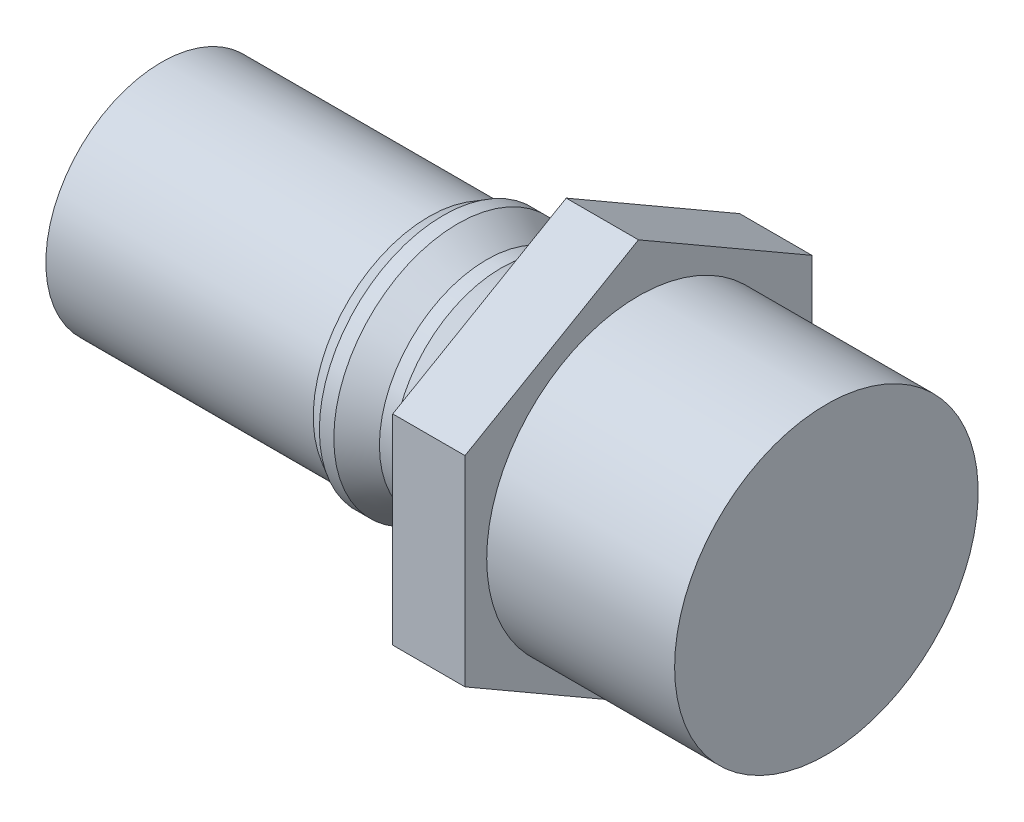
ISO-10303-21;
HEADER;
FILE_DESCRIPTION(('STEP AP214'),'2;1');
FILE_NAME('part.step','',(''),(''),'','','');
FILE_SCHEMA(('AUTOMOTIVE_DESIGN { 1 0 10303 214 1 1 1 1 }'));
ENDSEC;
DATA;
#1=APPLICATION_CONTEXT('core data for automotive mechanical design processes');
#2=APPLICATION_PROTOCOL_DEFINITION('international standard','automotive_design',2000,#1);
#3=PRODUCT_CONTEXT('',#1,'mechanical');
#4=PRODUCT('Part','Part','',(#3));
#5=PRODUCT_RELATED_PRODUCT_CATEGORY('part','',(#4));
#6=PRODUCT_DEFINITION_FORMATION('','',#4);
#7=PRODUCT_DEFINITION_CONTEXT('part definition',#1,'design');
#8=PRODUCT_DEFINITION('design','',#6,#7);
#9=PRODUCT_DEFINITION_SHAPE('','',#8);
#10=(LENGTH_UNIT() NAMED_UNIT(*) SI_UNIT(.MILLI.,.METRE.));
#11=(NAMED_UNIT(*) PLANE_ANGLE_UNIT() SI_UNIT($,.RADIAN.));
#12=(NAMED_UNIT(*) SI_UNIT($,.STERADIAN.) SOLID_ANGLE_UNIT());
#13=UNCERTAINTY_MEASURE_WITH_UNIT(LENGTH_MEASURE(1.E-05),#10,'distance_accuracy_value','');
#14=(GEOMETRIC_REPRESENTATION_CONTEXT(3) GLOBAL_UNCERTAINTY_ASSIGNED_CONTEXT((#13)) GLOBAL_UNIT_ASSIGNED_CONTEXT((#10,
#11,#12)) REPRESENTATION_CONTEXT('',''));
#15=CARTESIAN_POINT('',(0.,0.,0.));
#16=DIRECTION('',(0.,0.,1.));
#17=DIRECTION('',(1.,0.,0.));
#18=AXIS2_PLACEMENT_3D('',#15,#16,#17);
#19=CARTESIAN_POINT('',(0.,0.,0.));
#20=DIRECTION('',(-1.,0.,0.));
#21=DIRECTION('',(0.,-1.,0.));
#22=AXIS2_PLACEMENT_3D('',#19,#20,#21);
#23=PLANE('',#22);
#24=CARTESIAN_POINT('',(0.,0.,0.));
#25=DIRECTION('',(1.,0.,0.));
#26=DIRECTION('',(0.,1.,0.));
#27=AXIS2_PLACEMENT_3D('',#24,#25,#26);
#28=CIRCLE('',#27,8.);
#29=CARTESIAN_POINT('',(0.,8.,0.));
#30=VERTEX_POINT('',#29);
#31=EDGE_CURVE('E36',#30,#30,#28,.T.);
#32=ORIENTED_EDGE('',*,*,#31,.F.);
#33=EDGE_LOOP('',(#32));
#34=FACE_BOUND('',#33,.T.);
#35=ADVANCED_FACE('F33',(#34),#23,.T.);
#36=CARTESIAN_POINT('',(28.,0.,0.));
#37=DIRECTION('',(1.,0.,0.));
#38=DIRECTION('',(0.,1.,0.));
#39=AXIS2_PLACEMENT_3D('',#36,#37,#38);
#40=CYLINDRICAL_SURFACE('',#39,8.);
#41=ORIENTED_EDGE('',*,*,#31,.T.);
#42=EDGE_LOOP('',(#41));
#43=FACE_BOUND('',#42,.T.);
#44=CARTESIAN_POINT('',(18.5,0.,0.));
#45=DIRECTION('',(1.,0.,0.));
#46=DIRECTION('',(0.,1.,0.));
#47=AXIS2_PLACEMENT_3D('',#44,#45,#46);
#48=CIRCLE('',#47,8.);
#49=CARTESIAN_POINT('',(18.5,8.,0.));
#50=VERTEX_POINT('',#49);
#51=EDGE_CURVE('E156',#50,#50,#48,.T.);
#52=ORIENTED_EDGE('',*,*,#51,.F.);
#53=EDGE_LOOP('',(#52));
#54=FACE_BOUND('',#53,.T.);
#55=ADVANCED_FACE('F163',(#43,#54),#40,.T.);
#56=CARTESIAN_POINT('',(19.5,0.,0.));
#57=DIRECTION('',(1.,0.,0.));
#58=DIRECTION('',(0.,1.,0.));
#59=AXIS2_PLACEMENT_3D('',#56,#57,#58);
#60=CONICAL_SURFACE('',#59,8.57735026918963,0.5235987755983);
#61=ORIENTED_EDGE('',*,*,#51,.T.);
#62=EDGE_LOOP('',(#61));
#63=FACE_BOUND('',#62,.T.);
#64=CARTESIAN_POINT('',(19.5,0.,0.));
#65=DIRECTION('',(1.,0.,0.));
#66=DIRECTION('',(0.,1.,0.));
#67=AXIS2_PLACEMENT_3D('',#64,#65,#66);
#68=CIRCLE('',#67,8.57735026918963);
#69=CARTESIAN_POINT('',(19.5,8.57735026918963,0.));
#70=VERTEX_POINT('',#69);
#71=EDGE_CURVE('E154',#70,#70,#68,.T.);
#72=ORIENTED_EDGE('',*,*,#71,.F.);
#73=EDGE_LOOP('',(#72));
#74=FACE_BOUND('',#73,.T.);
#75=ADVANCED_FACE('F170',(#63,#74),#60,.T.);
#76=CARTESIAN_POINT('',(28.,0.,0.));
#77=DIRECTION('',(1.,0.,0.));
#78=DIRECTION('',(0.,1.,0.));
#79=AXIS2_PLACEMENT_3D('',#76,#77,#78);
#80=CYLINDRICAL_SURFACE('',#79,8.57735026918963);
#81=ORIENTED_EDGE('',*,*,#71,.T.);
#82=EDGE_LOOP('',(#81));
#83=FACE_BOUND('',#82,.T.);
#84=CARTESIAN_POINT('',(20.5,0.,0.));
#85=DIRECTION('',(1.,0.,0.));
#86=DIRECTION('',(0.,1.,0.));
#87=AXIS2_PLACEMENT_3D('',#84,#85,#86);
#88=CIRCLE('',#87,8.57735026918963);
#89=CARTESIAN_POINT('',(20.5,8.57735026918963,0.));
#90=VERTEX_POINT('',#89);
#91=EDGE_CURVE('E151',#90,#90,#88,.T.);
#92=ORIENTED_EDGE('',*,*,#91,.F.);
#93=EDGE_LOOP('',(#92));
#94=FACE_BOUND('',#93,.T.);
#95=ADVANCED_FACE('F174',(#83,#94),#80,.T.);
#96=CARTESIAN_POINT('',(22.5,0.,0.));
#97=DIRECTION('',(-1.,0.,0.));
#98=DIRECTION('',(0.,-1.,0.));
#99=AXIS2_PLACEMENT_3D('',#96,#97,#98);
#100=CONICAL_SURFACE('',#99,7.42264973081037,0.5235987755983);
#101=ORIENTED_EDGE('',*,*,#91,.T.);
#102=EDGE_LOOP('',(#101));
#103=FACE_BOUND('',#102,.T.);
#104=CARTESIAN_POINT('',(22.5,0.,0.));
#105=DIRECTION('',(1.,0.,0.));
#106=DIRECTION('',(0.,1.,0.));
#107=AXIS2_PLACEMENT_3D('',#104,#105,#106);
#108=CIRCLE('',#107,7.42264973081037);
#109=CARTESIAN_POINT('',(22.5,7.42264973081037,0.));
#110=VERTEX_POINT('',#109);
#111=EDGE_CURVE('E148',#110,#110,#108,.T.);
#112=ORIENTED_EDGE('',*,*,#111,.F.);
#113=EDGE_LOOP('',(#112));
#114=FACE_BOUND('',#113,.T.);
#115=ADVANCED_FACE('F179',(#103,#114),#100,.T.);
#116=CARTESIAN_POINT('',(28.,0.,0.));
#117=DIRECTION('',(1.,0.,0.));
#118=DIRECTION('',(0.,1.,0.));
#119=AXIS2_PLACEMENT_3D('',#116,#117,#118);
#120=CYLINDRICAL_SURFACE('',#119,7.42264973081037);
#121=ORIENTED_EDGE('',*,*,#111,.T.);
#122=EDGE_LOOP('',(#121));
#123=FACE_BOUND('',#122,.T.);
#124=CARTESIAN_POINT('',(23.5,0.,0.));
#125=DIRECTION('',(1.,0.,0.));
#126=DIRECTION('',(0.,1.,0.));
#127=AXIS2_PLACEMENT_3D('',#124,#125,#126);
#128=CIRCLE('',#127,7.42264973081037);
#129=CARTESIAN_POINT('',(23.5,7.42264973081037,0.));
#130=VERTEX_POINT('',#129);
#131=EDGE_CURVE('E145',#130,#130,#128,.T.);
#132=ORIENTED_EDGE('',*,*,#131,.F.);
#133=EDGE_LOOP('',(#132));
#134=FACE_BOUND('',#133,.T.);
#135=ADVANCED_FACE('F183',(#123,#134),#120,.T.);
#136=CARTESIAN_POINT('',(25.5,0.,0.));
#137=DIRECTION('',(1.,0.,0.));
#138=DIRECTION('',(0.,1.,0.));
#139=AXIS2_PLACEMENT_3D('',#136,#137,#138);
#140=CONICAL_SURFACE('',#139,8.57735026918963,0.5235987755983);
#141=ORIENTED_EDGE('',*,*,#131,.T.);
#142=EDGE_LOOP('',(#141));
#143=FACE_BOUND('',#142,.T.);
#144=CARTESIAN_POINT('',(25.5,0.,0.));
#145=DIRECTION('',(1.,0.,0.));
#146=DIRECTION('',(0.,1.,0.));
#147=AXIS2_PLACEMENT_3D('',#144,#145,#146);
#148=CIRCLE('',#147,8.57735026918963);
#149=CARTESIAN_POINT('',(25.5,8.57735026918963,0.));
#150=VERTEX_POINT('',#149);
#151=EDGE_CURVE('E142',#150,#150,#148,.T.);
#152=ORIENTED_EDGE('',*,*,#151,.F.);
#153=EDGE_LOOP('',(#152));
#154=FACE_BOUND('',#153,.T.);
#155=ADVANCED_FACE('F187',(#143,#154),#140,.T.);
#156=CARTESIAN_POINT('',(28.,0.,0.));
#157=DIRECTION('',(1.,0.,0.));
#158=DIRECTION('',(0.,1.,0.));
#159=AXIS2_PLACEMENT_3D('',#156,#157,#158);
#160=CYLINDRICAL_SURFACE('',#159,8.57735026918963);
#161=ORIENTED_EDGE('',*,*,#151,.T.);
#162=EDGE_LOOP('',(#161));
#163=FACE_BOUND('',#162,.T.);
#164=CARTESIAN_POINT('',(28.,0.,0.));
#165=DIRECTION('',(1.,0.,0.));
#166=DIRECTION('',(0.,1.,0.));
#167=AXIS2_PLACEMENT_3D('',#164,#165,#166);
#168=CIRCLE('',#167,8.57735026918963);
#169=CARTESIAN_POINT('',(28.,8.57735026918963,0.));
#170=VERTEX_POINT('',#169);
#171=EDGE_CURVE('E139',#170,#170,#168,.T.);
#172=ORIENTED_EDGE('',*,*,#171,.F.);
#173=EDGE_LOOP('',(#172));
#174=FACE_BOUND('',#173,.T.);
#175=ADVANCED_FACE('F191',(#163,#174),#160,.T.);
#176=CARTESIAN_POINT('',(33.,6.92820323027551,-12.));
#177=DIRECTION('',(0.,-0.866025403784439,0.5));
#178=DIRECTION('',(0.,-0.5,-0.866025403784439));
#179=AXIS2_PLACEMENT_3D('',#176,#177,#178);
#180=PLANE('',#179);
#181=DIRECTION('',(0.,0.5,0.866025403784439));
#182=VECTOR('',#181,1.);
#183=CARTESIAN_POINT('',(28.,6.92820323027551,-12.));
#184=LINE('',#183,#182);
#185=CARTESIAN_POINT('',(28.,6.92820323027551,-12.));
#186=VERTEX_POINT('',#185);
#187=CARTESIAN_POINT('',(28.,13.856406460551,0.));
#188=VERTEX_POINT('',#187);
#189=EDGE_CURVE('E119',#186,#188,#184,.T.);
#190=ORIENTED_EDGE('',*,*,#189,.T.);
#191=DIRECTION('',(-1.,0.,0.));
#192=VECTOR('',#191,1.);
#193=CARTESIAN_POINT('',(33.,13.856406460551,0.));
#194=LINE('',#193,#192);
#195=CARTESIAN_POINT('',(33.,13.856406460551,0.));
#196=VERTEX_POINT('',#195);
#197=EDGE_CURVE('E137',#196,#188,#194,.T.);
#198=ORIENTED_EDGE('',*,*,#197,.F.);
#199=DIRECTION('',(0.,0.5,0.866025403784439));
#200=VECTOR('',#199,1.);
#201=CARTESIAN_POINT('',(33.,6.92820323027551,-12.));
#202=LINE('',#201,#200);
#203=CARTESIAN_POINT('',(33.,6.92820323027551,-12.));
#204=VERTEX_POINT('',#203);
#205=EDGE_CURVE('E130',#204,#196,#202,.T.);
#206=ORIENTED_EDGE('',*,*,#205,.F.);
#207=DIRECTION('',(-1.,0.,0.));
#208=VECTOR('',#207,1.);
#209=CARTESIAN_POINT('',(33.,6.92820323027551,-12.));
#210=LINE('',#209,#208);
#211=EDGE_CURVE('E115',#204,#186,#210,.T.);
#212=ORIENTED_EDGE('',*,*,#211,.T.);
#213=EDGE_LOOP('',(#190,#198,#206,#212));
#214=FACE_BOUND('',#213,.T.);
#215=ADVANCED_FACE('F195',(#214),#180,.F.);
#216=CARTESIAN_POINT('',(33.,13.856406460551,0.));
#217=DIRECTION('',(0.,-0.866025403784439,-0.5));
#218=DIRECTION('',(0.,0.5,-0.866025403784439));
#219=AXIS2_PLACEMENT_3D('',#216,#217,#218);
#220=PLANE('',#219);
#221=DIRECTION('',(0.,-0.5,0.866025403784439));
#222=VECTOR('',#221,1.);
#223=CARTESIAN_POINT('',(28.,13.856406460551,0.));
#224=LINE('',#223,#222);
#225=CARTESIAN_POINT('',(28.,6.92820323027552,12.));
#226=VERTEX_POINT('',#225);
#227=EDGE_CURVE('E122',#188,#226,#224,.T.);
#228=ORIENTED_EDGE('',*,*,#227,.T.);
#229=DIRECTION('',(-1.,0.,0.));
#230=VECTOR('',#229,1.);
#231=CARTESIAN_POINT('',(33.,6.92820323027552,12.));
#232=LINE('',#231,#230);
#233=CARTESIAN_POINT('',(33.,6.92820323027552,12.));
#234=VERTEX_POINT('',#233);
#235=EDGE_CURVE('E134',#234,#226,#232,.T.);
#236=ORIENTED_EDGE('',*,*,#235,.F.);
#237=DIRECTION('',(0.,-0.5,0.866025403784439));
#238=VECTOR('',#237,1.);
#239=CARTESIAN_POINT('',(33.,13.856406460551,0.));
#240=LINE('',#239,#238);
#241=EDGE_CURVE('E88',#196,#234,#240,.T.);
#242=ORIENTED_EDGE('',*,*,#241,.F.);
#243=ORIENTED_EDGE('',*,*,#197,.T.);
#244=EDGE_LOOP('',(#228,#236,#242,#243));
#245=FACE_BOUND('',#244,.T.);
#246=ADVANCED_FACE('F199',(#245),#220,.F.);
#247=CARTESIAN_POINT('',(33.,6.92820323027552,12.));
#248=DIRECTION('',(0.,0.,-1.));
#249=DIRECTION('',(-1.,0.,0.));
#250=AXIS2_PLACEMENT_3D('',#247,#248,#249);
#251=PLANE('',#250);
#252=DIRECTION('',(0.,-1.,0.));
#253=VECTOR('',#252,1.);
#254=CARTESIAN_POINT('',(28.,6.92820323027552,12.));
#255=LINE('',#254,#253);
#256=CARTESIAN_POINT('',(28.,-6.9282032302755,12.));
#257=VERTEX_POINT('',#256);
#258=EDGE_CURVE('E125',#226,#257,#255,.T.);
#259=ORIENTED_EDGE('',*,*,#258,.T.);
#260=DIRECTION('',(-1.,0.,0.));
#261=VECTOR('',#260,1.);
#262=CARTESIAN_POINT('',(33.,-6.9282032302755,12.));
#263=LINE('',#262,#261);
#264=CARTESIAN_POINT('',(33.,-6.9282032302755,12.));
#265=VERTEX_POINT('',#264);
#266=EDGE_CURVE('E110',#265,#257,#263,.T.);
#267=ORIENTED_EDGE('',*,*,#266,.F.);
#268=DIRECTION('',(0.,-1.,0.));
#269=VECTOR('',#268,1.);
#270=CARTESIAN_POINT('',(33.,6.92820323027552,12.));
#271=LINE('',#270,#269);
#272=EDGE_CURVE('E101',#234,#265,#271,.T.);
#273=ORIENTED_EDGE('',*,*,#272,.F.);
#274=ORIENTED_EDGE('',*,*,#235,.T.);
#275=EDGE_LOOP('',(#259,#267,#273,#274));
#276=FACE_BOUND('',#275,.T.);
#277=ADVANCED_FACE('F203',(#276),#251,.F.);
#278=CARTESIAN_POINT('',(33.,-6.9282032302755,12.));
#279=DIRECTION('',(0.,0.866025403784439,-0.5));
#280=DIRECTION('',(0.,0.5,0.866025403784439));
#281=AXIS2_PLACEMENT_3D('',#278,#279,#280);
#282=PLANE('',#281);
#283=DIRECTION('',(0.,-0.5,-0.866025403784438));
#284=VECTOR('',#283,1.);
#285=CARTESIAN_POINT('',(28.,-6.9282032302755,12.));
#286=LINE('',#285,#284);
#287=CARTESIAN_POINT('',(28.,-13.856406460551,0.));
#288=VERTEX_POINT('',#287);
#289=EDGE_CURVE('E109',#257,#288,#286,.T.);
#290=ORIENTED_EDGE('',*,*,#289,.T.);
#291=DIRECTION('',(-1.,0.,0.));
#292=VECTOR('',#291,1.);
#293=CARTESIAN_POINT('',(33.,-13.856406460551,0.));
#294=LINE('',#293,#292);
#295=CARTESIAN_POINT('',(33.,-13.856406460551,0.));
#296=VERTEX_POINT('',#295);
#297=EDGE_CURVE('E106',#296,#288,#294,.T.);
#298=ORIENTED_EDGE('',*,*,#297,.F.);
#299=DIRECTION('',(0.,-0.5,-0.866025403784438));
#300=VECTOR('',#299,1.);
#301=CARTESIAN_POINT('',(33.,-6.9282032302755,12.));
#302=LINE('',#301,#300);
#303=EDGE_CURVE('E95',#265,#296,#302,.T.);
#304=ORIENTED_EDGE('',*,*,#303,.F.);
#305=ORIENTED_EDGE('',*,*,#266,.T.);
#306=EDGE_LOOP('',(#290,#298,#304,#305));
#307=FACE_BOUND('',#306,.T.);
#308=ADVANCED_FACE('F107',(#307),#282,.F.);
#309=CARTESIAN_POINT('',(33.,-13.856406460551,0.));
#310=DIRECTION('',(0.,0.866025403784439,0.5));
#311=DIRECTION('',(0.,-0.5,0.866025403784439));
#312=AXIS2_PLACEMENT_3D('',#309,#310,#311);
#313=PLANE('',#312);
#314=DIRECTION('',(0.,0.5,-0.866025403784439));
#315=VECTOR('',#314,1.);
#316=CARTESIAN_POINT('',(28.,-13.856406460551,0.));
#317=LINE('',#316,#315);
#318=CARTESIAN_POINT('',(28.,-6.92820323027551,-12.));
#319=VERTEX_POINT('',#318);
#320=EDGE_CURVE('E73',#288,#319,#317,.T.);
#321=ORIENTED_EDGE('',*,*,#320,.T.);
#322=DIRECTION('',(-1.,0.,0.));
#323=VECTOR('',#322,1.);
#324=CARTESIAN_POINT('',(33.,-6.92820323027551,-12.));
#325=LINE('',#324,#323);
#326=CARTESIAN_POINT('',(33.,-6.92820323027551,-12.));
#327=VERTEX_POINT('',#326);
#328=EDGE_CURVE('E111',#327,#319,#325,.T.);
#329=ORIENTED_EDGE('',*,*,#328,.F.);
#330=DIRECTION('',(0.,0.5,-0.866025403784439));
#331=VECTOR('',#330,1.);
#332=CARTESIAN_POINT('',(33.,-13.856406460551,0.));
#333=LINE('',#332,#331);
#334=EDGE_CURVE('E99',#296,#327,#333,.T.);
#335=ORIENTED_EDGE('',*,*,#334,.F.);
#336=ORIENTED_EDGE('',*,*,#297,.T.);
#337=EDGE_LOOP('',(#321,#329,#335,#336));
#338=FACE_BOUND('',#337,.T.);
#339=ADVANCED_FACE('F113',(#338),#313,.F.);
#340=CARTESIAN_POINT('',(33.,-6.92820323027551,-12.));
#341=DIRECTION('',(0.,0.,1.));
#342=DIRECTION('',(0.,-1.,0.));
#343=AXIS2_PLACEMENT_3D('',#340,#341,#342);
#344=PLANE('',#343);
#345=DIRECTION('',(0.,1.,0.));
#346=VECTOR('',#345,1.);
#347=CARTESIAN_POINT('',(28.,-6.92820323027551,-12.));
#348=LINE('',#347,#346);
#349=EDGE_CURVE('E79',#319,#186,#348,.T.);
#350=ORIENTED_EDGE('',*,*,#349,.T.);
#351=ORIENTED_EDGE('',*,*,#211,.F.);
#352=DIRECTION('',(0.,1.,0.));
#353=VECTOR('',#352,1.);
#354=CARTESIAN_POINT('',(33.,-6.92820323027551,-12.));
#355=LINE('',#354,#353);
#356=EDGE_CURVE('E50',#327,#204,#355,.T.);
#357=ORIENTED_EDGE('',*,*,#356,.F.);
#358=ORIENTED_EDGE('',*,*,#328,.T.);
#359=EDGE_LOOP('',(#350,#351,#357,#358));
#360=FACE_BOUND('',#359,.T.);
#361=ADVANCED_FACE('F211',(#360),#344,.F.);
#362=CARTESIAN_POINT('',(33.,0.,0.));
#363=DIRECTION('',(1.,0.,0.));
#364=DIRECTION('',(0.,0.,-1.));
#365=AXIS2_PLACEMENT_3D('',#362,#363,#364);
#366=PLANE('',#365);
#367=CARTESIAN_POINT('',(33.,0.,0.));
#368=DIRECTION('',(1.,0.,0.));
#369=DIRECTION('',(0.,0.,-1.));
#370=AXIS2_PLACEMENT_3D('',#367,#368,#369);
#371=CIRCLE('',#370,10.5);
#372=CARTESIAN_POINT('',(33.,0.,10.5));
#373=VERTEX_POINT('',#372);
#374=EDGE_CURVE('E11',#373,#373,#371,.T.);
#375=ORIENTED_EDGE('',*,*,#374,.F.);
#376=EDGE_LOOP('',(#375));
#377=FACE_BOUND('',#376,.T.);
#378=ORIENTED_EDGE('',*,*,#205,.T.);
#379=ORIENTED_EDGE('',*,*,#241,.T.);
#380=ORIENTED_EDGE('',*,*,#272,.T.);
#381=ORIENTED_EDGE('',*,*,#303,.T.);
#382=ORIENTED_EDGE('',*,*,#334,.T.);
#383=ORIENTED_EDGE('',*,*,#356,.T.);
#384=EDGE_LOOP('',(#378,#379,#380,#381,#382,#383));
#385=FACE_BOUND('',#384,.T.);
#386=ADVANCED_FACE('F97',(#377,#385),#366,.T.);
#387=CARTESIAN_POINT('',(28.,0.,0.));
#388=DIRECTION('',(1.,0.,0.));
#389=DIRECTION('',(0.,0.,-1.));
#390=AXIS2_PLACEMENT_3D('',#387,#388,#389);
#391=PLANE('',#390);
#392=ORIENTED_EDGE('',*,*,#171,.T.);
#393=EDGE_LOOP('',(#392));
#394=FACE_BOUND('',#393,.T.);
#395=ORIENTED_EDGE('',*,*,#189,.F.);
#396=ORIENTED_EDGE('',*,*,#349,.F.);
#397=ORIENTED_EDGE('',*,*,#320,.F.);
#398=ORIENTED_EDGE('',*,*,#289,.F.);
#399=ORIENTED_EDGE('',*,*,#258,.F.);
#400=ORIENTED_EDGE('',*,*,#227,.F.);
#401=EDGE_LOOP('',(#395,#396,#397,#398,#399,#400));
#402=FACE_BOUND('',#401,.T.);
#403=ADVANCED_FACE('F214',(#394,#402),#391,.F.);
#404=CARTESIAN_POINT('',(46.,0.,0.));
#405=DIRECTION('',(-1.,0.,0.));
#406=DIRECTION('',(0.,0.,1.));
#407=AXIS2_PLACEMENT_3D('',#404,#405,#406);
#408=CYLINDRICAL_SURFACE('',#407,10.5);
#409=CARTESIAN_POINT('',(46.,0.,0.));
#410=DIRECTION('',(1.,0.,0.));
#411=DIRECTION('',(0.,0.,-1.));
#412=AXIS2_PLACEMENT_3D('',#409,#410,#411);
#413=CIRCLE('',#412,10.5);
#414=CARTESIAN_POINT('',(46.,0.,10.5));
#415=VERTEX_POINT('',#414);
#416=EDGE_CURVE('E123',#415,#415,#413,.T.);
#417=CARTESIAN_POINT('',(46.,0.,10.5));
#418=CARTESIAN_POINT('',(45.8645833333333,0.,10.5));
#419=CARTESIAN_POINT('',(45.7291666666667,0.,10.5));
#420=CARTESIAN_POINT('',(45.4583333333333,0.,10.5));
#421=CARTESIAN_POINT('',(45.3229166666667,0.,10.5));
#422=CARTESIAN_POINT('',(45.0520833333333,0.,10.5));
#423=CARTESIAN_POINT('',(44.9166666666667,0.,10.5));
#424=CARTESIAN_POINT('',(44.6458333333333,0.,10.5));
#425=CARTESIAN_POINT('',(44.5104166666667,0.,10.5));
#426=CARTESIAN_POINT('',(44.2395833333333,0.,10.5));
#427=CARTESIAN_POINT('',(44.1041666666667,0.,10.5));
#428=CARTESIAN_POINT('',(43.8333333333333,0.,10.5));
#429=CARTESIAN_POINT('',(43.6979166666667,0.,10.5));
#430=CARTESIAN_POINT('',(43.4270833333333,0.,10.5));
#431=CARTESIAN_POINT('',(43.2916666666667,0.,10.5));
#432=CARTESIAN_POINT('',(43.0208333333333,0.,10.5));
#433=CARTESIAN_POINT('',(42.8854166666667,0.,10.5));
#434=CARTESIAN_POINT('',(42.6145833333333,0.,10.5));
#435=CARTESIAN_POINT('',(42.4791666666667,0.,10.5));
#436=CARTESIAN_POINT('',(42.2083333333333,0.,10.5));
#437=CARTESIAN_POINT('',(42.0729166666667,0.,10.5));
#438=CARTESIAN_POINT('',(41.8020833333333,0.,10.5));
#439=CARTESIAN_POINT('',(41.6666666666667,0.,10.5));
#440=CARTESIAN_POINT('',(41.3958333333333,0.,10.5));
#441=CARTESIAN_POINT('',(41.2604166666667,0.,10.5));
#442=CARTESIAN_POINT('',(40.9895833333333,0.,10.5));
#443=CARTESIAN_POINT('',(40.8541666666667,0.,10.5));
#444=CARTESIAN_POINT('',(40.5833333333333,0.,10.5));
#445=CARTESIAN_POINT('',(40.4479166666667,0.,10.5));
#446=CARTESIAN_POINT('',(40.1770833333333,0.,10.5));
#447=CARTESIAN_POINT('',(40.0416666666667,0.,10.5));
#448=CARTESIAN_POINT('',(39.7708333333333,0.,10.5));
#449=CARTESIAN_POINT('',(39.6354166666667,0.,10.5));
#450=CARTESIAN_POINT('',(39.3645833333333,0.,10.5));
#451=CARTESIAN_POINT('',(39.2291666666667,0.,10.5));
#452=CARTESIAN_POINT('',(38.9583333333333,0.,10.5));
#453=CARTESIAN_POINT('',(38.8229166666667,0.,10.5));
#454=CARTESIAN_POINT('',(38.5520833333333,0.,10.5));
#455=CARTESIAN_POINT('',(38.4166666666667,0.,10.5));
#456=CARTESIAN_POINT('',(38.1458333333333,0.,10.5));
#457=CARTESIAN_POINT('',(38.0104166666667,0.,10.5));
#458=CARTESIAN_POINT('',(37.7395833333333,0.,10.5));
#459=CARTESIAN_POINT('',(37.6041666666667,0.,10.5));
#460=CARTESIAN_POINT('',(37.3333333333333,0.,10.5));
#461=CARTESIAN_POINT('',(37.1979166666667,0.,10.5));
#462=CARTESIAN_POINT('',(36.9270833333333,0.,10.5));
#463=CARTESIAN_POINT('',(36.7916666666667,0.,10.5));
#464=CARTESIAN_POINT('',(36.5208333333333,0.,10.5));
#465=CARTESIAN_POINT('',(36.3854166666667,0.,10.5));
#466=CARTESIAN_POINT('',(36.1145833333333,0.,10.5));
#467=CARTESIAN_POINT('',(35.9791666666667,0.,10.5));
#468=CARTESIAN_POINT('',(35.7083333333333,0.,10.5));
#469=CARTESIAN_POINT('',(35.5729166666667,0.,10.5));
#470=CARTESIAN_POINT('',(35.3020833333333,0.,10.5));
#471=CARTESIAN_POINT('',(35.1666666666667,0.,10.5));
#472=CARTESIAN_POINT('',(34.8958333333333,0.,10.5));
#473=CARTESIAN_POINT('',(34.7604166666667,0.,10.5));
#474=CARTESIAN_POINT('',(34.4895833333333,0.,10.5));
#475=CARTESIAN_POINT('',(34.3541666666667,0.,10.5));
#476=CARTESIAN_POINT('',(34.0833333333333,0.,10.5));
#477=CARTESIAN_POINT('',(33.9479166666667,0.,10.5));
#478=CARTESIAN_POINT('',(33.6770833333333,0.,10.5));
#479=CARTESIAN_POINT('',(33.5416666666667,0.,10.5));
#480=CARTESIAN_POINT('',(33.2708333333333,0.,10.5));
#481=CARTESIAN_POINT('',(33.1354166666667,0.,10.5));
#482=CARTESIAN_POINT('',(33.,0.,10.5));
#483=B_SPLINE_CURVE_WITH_KNOTS('',3,(#417,#418,#419,#420,#421,#422,#423,#424,#425,#426,#427,
#428,#429,#430,#431,#432,#433,#434,#435,#436,#437,#438,#439,#440,#441,#442,#443,#444,#445,#446,
#447,#448,#449,#450,#451,#452,#453,#454,#455,#456,#457,#458,#459,#460,#461,#462,#463,#464,#465,
#466,#467,#468,#469,#470,#471,#472,#473,#474,#475,#476,#477,#478,#479,#480,#481,#482),
.UNSPECIFIED.,.F.,.F.,(4,2,2,2,2,2,2,2,2,2,2,2,2,2,2,2,2,2,2,2,2,2,2,2,2,2,2,2,2,2,2,2,4),(0.,
0.406249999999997,0.812499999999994,1.21875,1.62499999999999,2.03125,2.4375,2.84374999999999,
3.25,3.65624999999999,4.0625,4.46874999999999,4.875,5.28124999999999,5.6875,6.09374999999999,
6.49999999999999,6.90625,7.31249999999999,7.71875,8.12499999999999,8.53124999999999,
8.93749999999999,9.34374999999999,9.74999999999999,10.15625,10.5625,10.96875,11.375,11.78125,
12.1875,12.59375,13.),.UNSPECIFIED.);
#484=EDGE_CURVE('BSEAM217',#415,#373,#483,.T.);
#485=ORIENTED_EDGE('',*,*,#416,.F.);
#486=ORIENTED_EDGE('',*,*,#374,.T.);
#487=ORIENTED_EDGE('',*,*,#484,.T.);
#488=ORIENTED_EDGE('',*,*,#484,.F.);
#489=EDGE_LOOP('',(#485,#487,#486,#488));
#490=FACE_BOUND('',#489,.T.);
#491=ADVANCED_FACE('F217',(#490),#408,.T.);
#492=CARTESIAN_POINT('',(46.,0.,0.));
#493=DIRECTION('',(1.,0.,0.));
#494=DIRECTION('',(0.,0.,-1.));
#495=AXIS2_PLACEMENT_3D('',#492,#493,#494);
#496=PLANE('',#495);
#497=ORIENTED_EDGE('',*,*,#416,.T.);
#498=EDGE_LOOP('',(#497));
#499=FACE_BOUND('',#498,.T.);
#500=ADVANCED_FACE('F224',(#499),#496,.T.);
#501=CLOSED_SHELL('',(#35,#55,#75,#95,#115,#135,#155,#175,#215,#246,#277,#308,#339,#361,#386,
#403,#491,#500));
#502=MANIFOLD_SOLID_BREP('B2',#501);
#503=ADVANCED_BREP_SHAPE_REPRESENTATION('',(#18,#502),#14);
#504=SHAPE_DEFINITION_REPRESENTATION(#9,#503);
ENDSEC;
END-ISO-10303-21;
